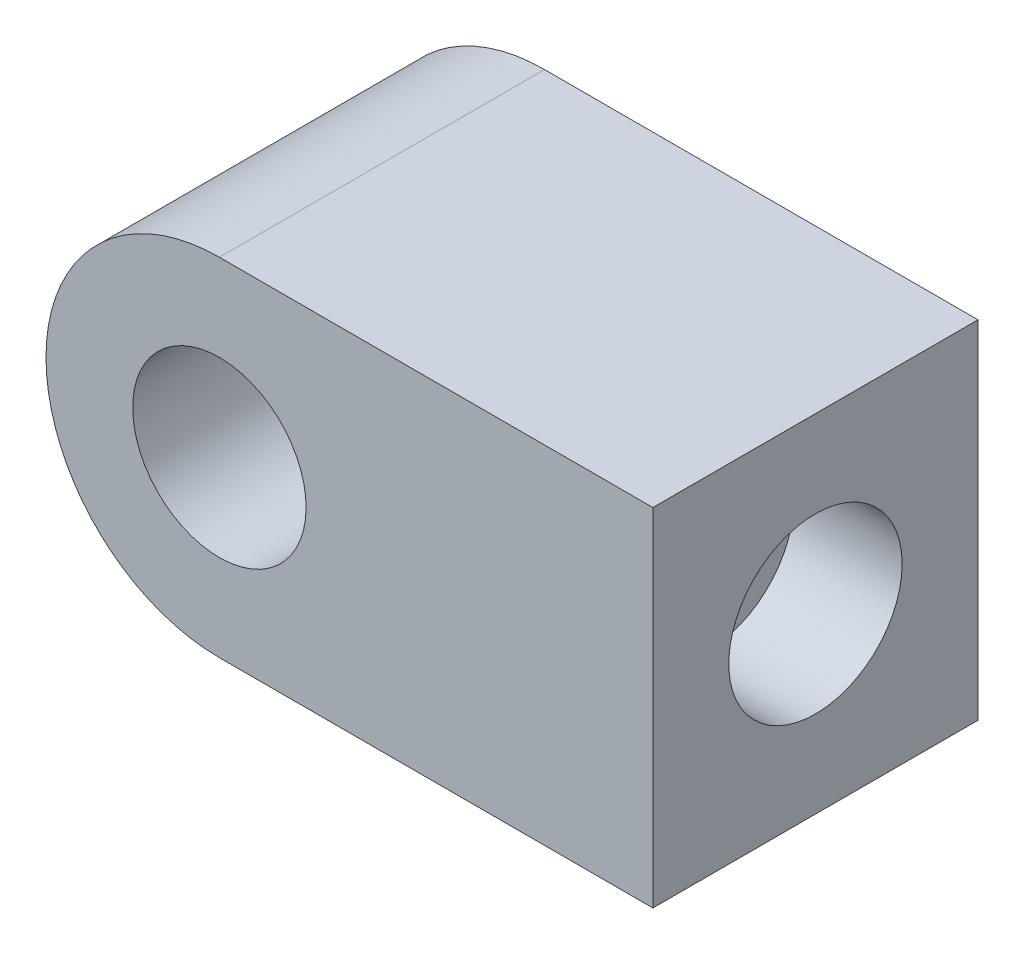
from build123d import *

# Parameters (mm, degrees)
IZIM1_R                     = 4
Y_KSEKLIK_EKSTR_ZYON1_DEPTH = 15
IZIM2_R                     = 4
KES_EKSTR_ZYON1_DEPTH       = 5


with BuildPart() as part:
    # izim1 → Y_kseklik-Ekstr_zyon1 (new body)
    with BuildSketch(Plane.XY):
        with BuildLine():
            Line((0, 8), (20, 8))
            Line((20, 8), (20, -8))
            Line((20, -8), (0, -8))
            ThreePointArc((0, -8), (-8, 0), (0, 8))
        make_face()
        Circle(IZIM1_R, mode=Mode.SUBTRACT)
    extrude(amount=Y_KSEKLIK_EKSTR_ZYON1_DEPTH)

    # izim2 → Kes-Ekstr_zyon1 (cut)
    with BuildSketch(Plane(origin=(20, 0, 0), x_dir=(0, 0, -1), z_dir=(1, 0, 0))):
        with Locations((-7.5, 0)):
            Circle(IZIM2_R)
    extrude(amount=-KES_EKSTR_ZYON1_DEPTH, mode=Mode.SUBTRACT)


solid = part.part
